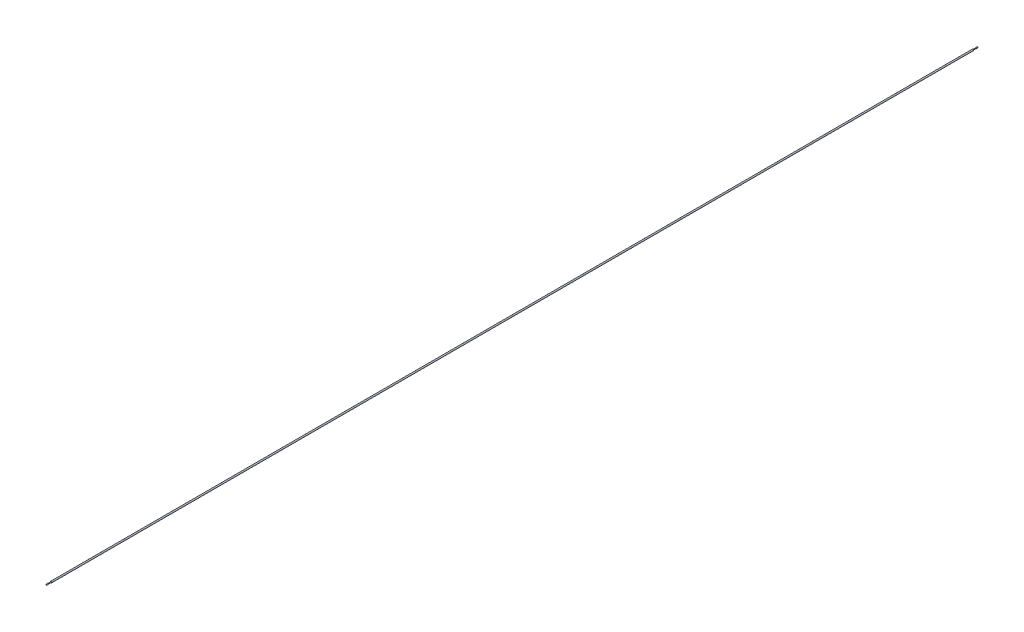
from build123d import *

# Parameters (mm, degrees)
SKETCH1_R           = 3.175
SKETCH1_R_2         = 2.413
BOSS_EXTRUDE1_DEPTH = 2133.6
BOSS_EXTRUDE2_START = 3.81
SKETCH2_R           = 3.175
BOSS_EXTRUDE2_DEPTH = 3.81
SKETCH3_R           = 1.5875
BOSS_EXTRUDE3_DEPTH = 12.7
SKETCH4_R           = 2.3495
BOSS_EXTRUDE4_DEPTH = 8.89
CHAMFER1_SIZE       = 0.635
CHAMFER2_SIZE       = 0.635


with BuildPart() as part:
    # Sketch1 → Boss-Extrude1 (new, symmetric)
    with BuildSketch(Plane.XY):
        Circle(SKETCH1_R)
        Circle(SKETCH1_R_2, mode=Mode.SUBTRACT)
    extrude(amount=BOSS_EXTRUDE1_DEPTH, both=True)

    # Sketch2 → Boss-Extrude2 (add)
    with BuildSketch(Plane.XY.offset(2133.6).offset(BOSS_EXTRUDE2_START)):
        Circle(SKETCH2_R)
    boss_extrude2 = extrude(amount=-BOSS_EXTRUDE2_DEPTH)

    # Sketch3 → Boss-Extrude3 (add)
    with BuildSketch(Plane.XY.offset(2137.41)):
        Circle(SKETCH3_R)
    boss_extrude3 = extrude(amount=BOSS_EXTRUDE3_DEPTH)

    # Sketch4 → Boss-Extrude4 (add)
    with BuildSketch(Plane.XY.offset(2150.11)):
        Circle(SKETCH4_R)
    boss_extrude4 = extrude(amount=BOSS_EXTRUDE4_DEPTH)

    # Chamfer1
    chamfer1_edges = [part.edges().sort_by_distance(p)[0] for p in [
        (-2.3495, 0, 2150.11),
        (-2.3495, 0, 2159),
    ]]
    chamfer(chamfer1_edges, length=CHAMFER1_SIZE)

    # Mirror3: Boss-Extrude2, Boss-Extrude3, Boss-Extrude4 across plane
    add(boss_extrude2.mirror(Plane.XY))
    add(boss_extrude3.mirror(Plane.XY))
    add(boss_extrude4.mirror(Plane.XY))

    # Chamfer2
    chamfer2_edges = [part.edges().sort_by_distance(p)[0] for p in [
        (-2.3495, 0, -2159),
        (-2.3495, 0, -2150.11),
    ]]
    chamfer(chamfer2_edges, length=CHAMFER2_SIZE)


solid = part.part
